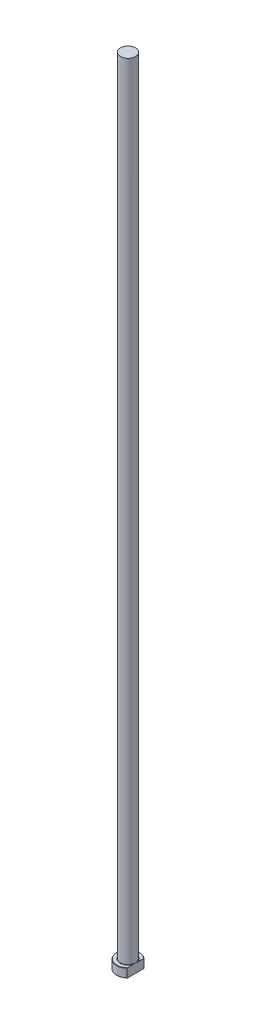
from build123d import *
from build123d.topology import SkipClean

# Parameters (mm, degrees)
CHAMFER1_SIZE = 0.2
FILLET1_R     = 0.3
KEY_DEPTH     = 631.128558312


with BuildPart() as part:
    # Sketch1 → Revolve1 (revolve)
    with BuildSketch(Plane.XY, mode=Mode.PRIVATE) as revolve1_sk:
        Polygon((0, 0), (-9, 0), (-9, 7), (-6, 7), (-6, 630), (0, 630), align=None)
    revolve(revolve1_sk.sketch.rotate(Axis((0, 259.958771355, 0), (0, -1, 0)), 270), axis=Axis((0, 259.958771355, 0), (0, -1, 0)))

    # Chamfer1
    chamfer1_edges = [part.edges().sort_by_distance(p)[0] for p in [
        (0, 7, -9),
        (0, 0, -9),
    ]]
    chamfer(chamfer1_edges, length=CHAMFER1_SIZE)

    # Fillet1
    fillet1_edges = [part.edges().sort_by_distance(p)[0] for p in [
        (0, 7, -6),
    ]]
    fillet(fillet1_edges, radius=FILLET1_R)

    # Sketch2 → KEY (cut, through all)
    with SkipClean():  # the faces are left unmerged after this step: merging them gives an invalid solid
        with BuildSketch(Plane(origin=(0, 0, 0), x_dir=(1, 0, 0), z_dir=(0, 1, 0))):
            with BuildLine():
                Line((6, 6.708203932), (6, -6.708203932))
                ThreePointArc((6, -6.708203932), (9, 0), (6, 6.708203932))
            make_face()
        extrude(amount=KEY_DEPTH, mode=Mode.SUBTRACT)


solid = part.part
